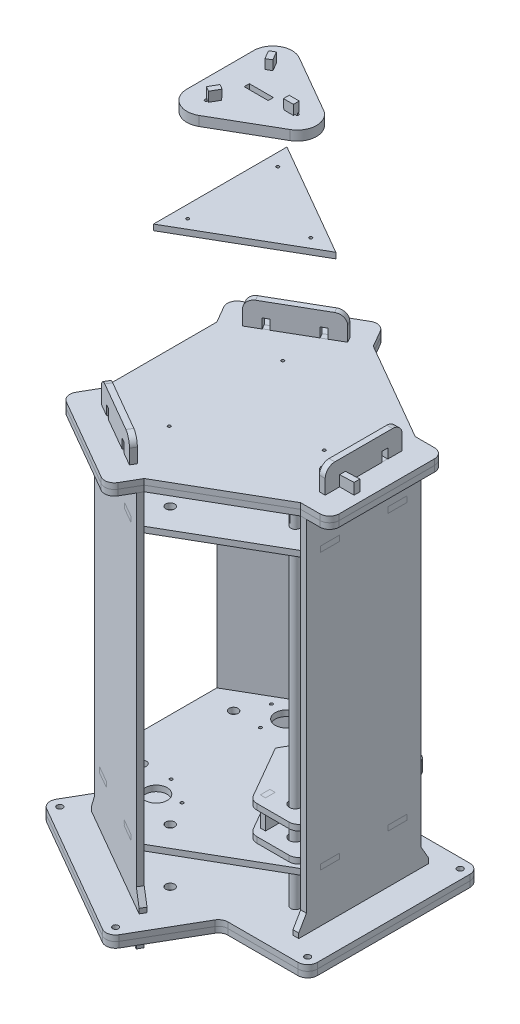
from build123d import *

# Parameters (mm, degrees)
SKETCH2_W              = 6
SKETCH2_H              = 118.934155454
BOSS_EXTRUDE1_DEPTH    = 447
BOSS_EXTRUDE2_DEPTH    = 6
BOSS_EXTRUDE3_DEPTH    = 6
BOSS_EXTRUDE4_DEPTH    = 6
BOSS_EXTRUDE5_DEPTH    = 6
SKETCH8_R              = 4.6
CUT_EXTRUDE1_DEPTH     = 469.664858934
SKETCH9_R              = 1.5
CUT_EXTRUDE3_DEPTH     = 469.664858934
SKETCH10_R             = 6
CUT_EXTRUDE5_DEPTH     = 469.664858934
BOSS_EXTRUDE6_DEPTH    = 6
BOSS_EXTRUDE7_DEPTH    = 6
SKETCH29_W             = 6
SKETCH29_H             = 118.934155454
SKETCH29_W_2           = 5.4
SKETCH29_H_2           = 118.334155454
BOSS_EXTRUDE15_DEPTH   = 6
FILLET1_R              = 10
SKETCH13_W             = 20
SKETCH13_H             = 6
CUT_EXTRUDE7_DEPTH     = 469.664858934
SKETCH30_W             = 20
SKETCH30_H             = 6
SKETCH30_W_2           = 19.4
SKETCH30_H_2           = 5.4
BOSS_EXTRUDE16_DEPTH   = 6
SKETCH15_W             = 20
SKETCH15_H             = 6
BOSS_EXTRUDE8_DEPTH    = 6
SKETCH16_R             = 1.5
CUT_EXTRUDE8_DEPTH     = 391.989449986
SKETCH17_R             = 11.5
CUT_EXTRUDE9_DEPTH     = 10
BOSS_EXTRUDE9_DEPTH    = 6
SKETCH31_W             = 6
SKETCH31_H             = 80
SKETCH31_W_2           = 5.4
SKETCH31_H_2           = 79.4
BOSS_EXTRUDE17_DEPTH   = 6
SKETCH19_W             = 19.467077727
SKETCH19_H             = 37
CUT_EXTRUDE10_DEPTH    = 6
FILLET2_R              = 10
SKETCH20_W             = 20
SKETCH20_H             = 6
CUT_EXTRUDE11_DEPTH    = 469.664858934
SKETCH32_W             = 20
SKETCH32_H             = 6
SKETCH32_W_2           = 19.4
SKETCH32_H_2           = 5.4
BOSS_EXTRUDE18_DEPTH   = 6
BOSS_EXTRUDE10_REACH   = 470.665
SKETCH21_W             = 20
SKETCH21_H             = 6
FILLET3_R              = 10
SKETCH22_W             = 6
SKETCH22_H             = 10
CUT_EXTRUDE12_DEPTH    = 6
SKETCH25_R             = 1.5
SKETCH25_W             = 5.4
SKETCH25_H             = 79.4
BOSS_EXTRUDE13_DEPTH   = 6
BOSS_EXTRUDE11_DEPTH   = 6
FILLET4_R              = 6
SKETCH24_W             = 5.4
SKETCH24_H             = 118.334155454
BOSS_EXTRUDE12_DEPTH   = 6
SKETCH27_R             = 4.6
BOSS_EXTRUDE14_DEPTH   = 385
BOSS_EXTRUDE14_2_DEPTH = 385
SKETCH28_R             = 3
CUT_EXTRUDE13_DEPTH    = 443.33104119
SKETCH33_R             = 1.5
BOSS_EXTRUDE19_DEPTH   = 10
SKETCH34_W             = 10
SKETCH34_H             = 6
CUT_EXTRUDE14_DEPTH    = 730.147961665
BOSS_EXTRUDE20_DEPTH   = 6
FILLET8_R              = 8
SKETCH37_R             = 1.5
BOSS_EXTRUDE21_DEPTH   = 6
SKETCH41_R             = 6.25
BOSS_EXTRUDE22_DEPTH   = 6
SKETCH42_R             = 2.1
BOSS_EXTRUDE23_DEPTH   = 6
SKETCH43_R             = 6.25
SKETCH43_R_2           = 6.2
SKETCH43_R_3           = 1.5
BOSS_EXTRUDE24_DEPTH   = 6
SKETCH44_R             = 1.5
BOSS_EXTRUDE25_DEPTH   = 36
SKETCH45_R             = 2.1
CUT_EXTRUDE16_DEPTH    = 615.063669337
SKETCH46_W             = 44
SKETCH46_H             = 5.4
BOSS_EXTRUDE26_DEPTH   = 23.8
SKETCH48_W             = 20
SKETCH48_H             = 5.4
CUT_EXTRUDE17_DEPTH    = 615.063669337
SKETCH49_W             = 20
SKETCH49_H             = 35.8
BOSS_EXTRUDE27_DEPTH   = 5.4
SKETCH50_W             = 83.679491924
SKETCH50_H             = 59.467077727
CUT_EXTRUDE18_DEPTH    = 615.063669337
FILLET9_R              = 10
FILLET10_R             = 10
BOSS_EXTRUDE29_DEPTH   = 5.4
SKETCH54_W             = 5.4
SKETCH54_H             = 10
CUT_EXTRUDE20_DEPTH    = 615.063669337
SKETCH55_W             = 10
SKETCH55_H             = 6
CUT_EXTRUDE21_DEPTH    = 615.063669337
BOSS_EXTRUDE31_DEPTH   = 6
CIRPATTERN1_COUNT      = 3
FILLET5_R              = 10
FILLET7_R              = 10
SKETCH36_W             = 25
SKETCH36_H             = 5.4
CUT_EXTRUDE15_DEPTH    = 743.308250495
FILLET11_R             = 8


with BuildPart() as part:
    # Sketch2 → Boss-Extrude1 (new body)
    with BuildSketch(Plane(origin=(0, 0, 0), x_dir=(1, 0, 0), z_dir=(0, 1, 0))):
        with Locations((106, 0)):
            Rectangle(SKETCH2_W, SKETCH2_H)
    extrude(amount=BOSS_EXTRUDE1_DEPTH)

    # Sketch12 → Boss-Extrude7 (add)
    with BuildSketch(Plane(origin=(109, 0, 0), x_dir=(0, 0, -1), z_dir=(1, 0, 0))):
        Polygon((-59.467077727, 37), (-59.467077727, 55.856406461), (-67.467077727, 42), (-67.467077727, 37), align=None)
    boss_extrude7 = extrude(amount=-BOSS_EXTRUDE7_DEPTH)

    # Mirror1: Boss-Extrude7 across plane
    add(boss_extrude7.mirror(Plane.XY))

    # Sketch13 → Cut-Extrude7 (cut, through all)
    with BuildSketch(Plane(origin=(109, 0, 0), x_dir=(0, 0, -1), z_dir=(1, 0, 0))):
        with Locations((-35, 90)):
            Rectangle(SKETCH13_W, SKETCH13_H)
    cut_extrude7 = extrude(amount=-CUT_EXTRUDE7_DEPTH, mode=Mode.SUBTRACT)

    # Sketch30 → Boss-Extrude16 (add)
    with BuildSketch(Plane(origin=(109, 0, 0), x_dir=(0, 0, -1), z_dir=(1, 0, 0))):
        with Locations((-35, 90)):
            Rectangle(SKETCH30_W, SKETCH30_H)
        with Locations((-35, 90)):
            Rectangle(SKETCH30_W_2, SKETCH30_H_2, mode=Mode.SUBTRACT)
    boss_extrude16 = extrude(amount=-BOSS_EXTRUDE16_DEPTH)

    # Mirror3: Cut-Extrude7 across plane
    add(cut_extrude7.mirror(Plane.XY), mode=Mode.SUBTRACT)

    # Mirror3 2: Boss-Extrude16 across plane
    add(boss_extrude16.mirror(Plane.XY))

    # Sketch19 → Cut-Extrude10 (cut)
    with BuildSketch(Plane(origin=(109, 0, 0), x_dir=(0, 0, -1), z_dir=(1, 0, 0))):
        with Locations((-49.733538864, 428.5)):
            Rectangle(SKETCH19_W, SKETCH19_H)
        with Locations((49.733538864, 428.5)):
            Rectangle(SKETCH19_W, SKETCH19_H)
    extrude(amount=-CUT_EXTRUDE10_DEPTH, mode=Mode.SUBTRACT)

    # Sketch20 → Cut-Extrude11 (cut, through all)
    with BuildSketch(Plane(origin=(109, 0, 0), x_dir=(0, 0, -1), z_dir=(1, 0, 0))):
        with Locations((-35, 376)):
            Rectangle(SKETCH20_W, SKETCH20_H)
    cut_extrude11 = extrude(amount=-CUT_EXTRUDE11_DEPTH, mode=Mode.SUBTRACT)

    # Sketch32 → Boss-Extrude18 (add)
    with BuildSketch(Plane(origin=(109, 0, 0), x_dir=(0, 0, -1), z_dir=(1, 0, 0))):
        with Locations((-35, 376)):
            Rectangle(SKETCH32_W, SKETCH32_H)
        with Locations((-35, 376)):
            Rectangle(SKETCH32_W_2, SKETCH32_H_2, mode=Mode.SUBTRACT)
    boss_extrude18 = extrude(amount=-BOSS_EXTRUDE18_DEPTH)

    # Mirror5: Cut-Extrude11 across plane
    add(cut_extrude11.mirror(Plane.XY), mode=Mode.SUBTRACT)

    # Mirror5 2: Boss-Extrude18 across plane
    add(boss_extrude18.mirror(Plane.XY))

    # Fillet3
    fillet3_edges = [part.edges().sort_by_distance(p)[0] for p in [
        (106, 447, 40),
        (106, 447, -40),
    ]]
    fillet(fillet3_edges, radius=FILLET3_R)

    # Sketch22 → Cut-Extrude12 (cut)
    with BuildSketch(Plane.XY.offset(25)):
        with Locations((106, 427)):
            Rectangle(SKETCH22_W, SKETCH22_H)
        with Locations((106, 20)):
            Rectangle(SKETCH22_W, SKETCH22_H)
    cut_extrude12 = extrude(amount=-CUT_EXTRUDE12_DEPTH, mode=Mode.SUBTRACT)

    # Mirror7: Cut-Extrude12 across plane
    add(cut_extrude12.mirror(Plane.XY), mode=Mode.SUBTRACT)


with BuildPart() as body_2:
    # Sketch4 → Boss-Extrude2 (new body)
    with BuildSketch(Plane(origin=(0, 31, 0), x_dir=(1, 0, 0), z_dir=(0, 1, 0))):
        Polygon((51.5, -89.20061659), (0, 0), (51.5, 89.20061659), (103, 59.467077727), (103, -59.467077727), align=None)
    extrude(amount=BOSS_EXTRUDE2_DEPTH)


with BuildPart() as body_3:
    # Sketch5 → Boss-Extrude3 (new body)
    with BuildSketch(Plane(origin=(0, 87, 0), x_dir=(1, 0, 0), z_dir=(0, 1, 0))):
        Polygon((51.5, 89.20061659), (0, 0), (51.5, -89.20061659), (103, -59.467077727), (103, 59.467077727), align=None)
    extrude(amount=BOSS_EXTRUDE3_DEPTH)


with BuildPart() as body_4:
    # Sketch6 → Boss-Extrude4 (new body)
    with BuildSketch(Plane(origin=(0, 373, 0), x_dir=(1, 0, 0), z_dir=(0, 1, 0))):
        Polygon((51.5, 89.20061659), (0, 0), (51.5, -89.20061659), (103, -59.467077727), (103, 59.467077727), align=None)
    extrude(amount=BOSS_EXTRUDE4_DEPTH)


with BuildPart() as body_5:
    # Sketch7 → Boss-Extrude5 (new body)
    with BuildSketch(Plane(origin=(0, 410, 0), x_dir=(1, 0, 0), z_dir=(0, 1, 0))):
        Polygon((51.5, 89.20061659), (0, 0), (51.5, -89.20061659), (103, -59.467077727), (103, 59.467077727), align=None)
    extrude(amount=BOSS_EXTRUDE5_DEPTH)


with BuildPart() as cut_extrude1_tool:
    # Sketch8 → Cut-Extrude1 (new, through all)
    with BuildSketch(Plane(origin=(0, 0, 0), x_dir=(1, 0, 0), z_dir=(0, 1, 0))):
        with Locations(Location((78, 40, 0), (0, 0, 270))):
            Circle(SKETCH8_R)
        with Locations(Location((78, -40, 0), (0, 0, 270))):
            Circle(SKETCH8_R)
    extrude(amount=CUT_EXTRUDE1_DEPTH)


with BuildPart() as body_2_1:
    add(body_2.part)

    # Cut-Extrude1: cut by cut_extrude1_tool
    add(cut_extrude1_tool.part, mode=Mode.SUBTRACT)

    # Sketch11 → Boss-Extrude6 (add)
    with BuildSketch(Plane(origin=(0, 37, 0), x_dir=(1, 0, 0), z_dir=(0, 1, 0))):
        Polygon((51.5, 89.20061659), (140, 89.20061659), (140, -89.20061659), (51.5, -89.20061659), (103, -59.467077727), (109, -59.467077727), (109, 59.467077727), (103, 59.467077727), align=None)
    extrude(amount=-BOSS_EXTRUDE6_DEPTH)

    # Sketch29 → Boss-Extrude15 (add)
    with BuildSketch(Plane(origin=(0, 37, 0), x_dir=(1, 0, 0), z_dir=(0, 1, 0))):
        with Locations((106, 0)):
            Rectangle(SKETCH29_W, SKETCH29_H)
        with Locations((106, 0)):
            Rectangle(SKETCH29_W_2, SKETCH29_H_2, mode=Mode.SUBTRACT)
    extrude(amount=-BOSS_EXTRUDE15_DEPTH)

    # Fillet1
    fillet1_edges = [body_2_1.edges().sort_by_distance(p)[0] for p in [
        (140, 34, -89.20061659),
        (140, 34, 89.20061659),
    ]]
    fillet(fillet1_edges, radius=FILLET1_R)


with BuildPart() as body_3_1:
    add(body_3.part)

    # Cut-Extrude1: cut by cut_extrude1_tool
    add(cut_extrude1_tool.part, mode=Mode.SUBTRACT)


with BuildPart() as body_4_1:
    add(body_4.part)

    # Cut-Extrude1: cut by cut_extrude1_tool
    add(cut_extrude1_tool.part, mode=Mode.SUBTRACT)


with BuildPart() as body_5_1:
    add(body_5.part)

    # Cut-Extrude1: cut by cut_extrude1_tool
    add(cut_extrude1_tool.part, mode=Mode.SUBTRACT)


with BuildPart() as cut_extrude3_tool:
    # Sketch9 → Cut-Extrude3 (new, through all)
    with BuildSketch(Plane(origin=(0, 0, 0), x_dir=(1, 0, 0), z_dir=(0, 1, 0))):
        with Locations(Location((68, 0, 0), (0, 0, 270))):
            Circle(SKETCH9_R)
    extrude(amount=CUT_EXTRUDE3_DEPTH)


with BuildPart() as body_4_2:
    add(body_4_1.part)

    # Cut-Extrude3: cut by cut_extrude3_tool
    add(cut_extrude3_tool.part, mode=Mode.SUBTRACT)


with BuildPart() as body_5_2:
    add(body_5_1.part)

    # Cut-Extrude3: cut by cut_extrude3_tool
    add(cut_extrude3_tool.part, mode=Mode.SUBTRACT)


with BuildPart() as cut_extrude5_tool:
    # Sketch10 → Cut-Extrude5 (new, through all)
    with BuildSketch(Plane(origin=(0, 0, 0), x_dir=(1, 0, 0), z_dir=(0, 1, 0))):
        with Locations(Location((78, 0, 0), (0, 0, 270))):
            Circle(SKETCH10_R)
    extrude(amount=CUT_EXTRUDE5_DEPTH)


with BuildPart() as body_3_2:
    add(body_3_1.part)

    # Cut-Extrude5: cut by cut_extrude5_tool
    add(cut_extrude5_tool.part, mode=Mode.SUBTRACT)

    # Sketch15 → Boss-Extrude8 (add)
    with BuildSketch(Plane(origin=(103, 0, 0), x_dir=(0, 0, -1), z_dir=(1, 0, 0))):
        with Locations((-35, 90)):
            Rectangle(SKETCH15_W, SKETCH15_H)
    boss_extrude8 = extrude(amount=BOSS_EXTRUDE8_DEPTH)

    # Mirror4: Boss-Extrude8 across plane
    add(boss_extrude8.mirror(Plane.XY))

    # Sketch16 → Cut-Extrude8 (cut, through all)
    with BuildSketch(Plane(origin=(0, 93, 0), x_dir=(1, 0, 0), z_dir=(0, 1, 0))):
        with Locations(Location((62.5, -15.5, 0), (0, 0, 270))):
            Circle(SKETCH16_R)
        with Locations(Location((62.5, 15.5, 0), (0, 0, 270))):
            Circle(SKETCH16_R)
        with Locations(Location((93.5, 15.5, 0), (0, 0, 270))):
            Circle(SKETCH16_R)
        with Locations(Location((93.5, -15.5, 0), (0, 0, 270))):
            Circle(SKETCH16_R)
    extrude(amount=-CUT_EXTRUDE8_DEPTH, mode=Mode.SUBTRACT)

    # Sketch17 → Cut-Extrude9 (cut)
    with BuildSketch(Plane(origin=(0, 93, 0), x_dir=(1, 0, 0), z_dir=(0, 1, 0))):
        with Locations(Location((78, 0, 0), (0, 0, 270))):
            Circle(SKETCH17_R)
    extrude(amount=-CUT_EXTRUDE9_DEPTH, mode=Mode.SUBTRACT)


with BuildPart() as body_4_3:
    add(body_4_2.part)

    # Cut-Extrude5: cut by cut_extrude5_tool
    add(cut_extrude5_tool.part, mode=Mode.SUBTRACT)

    # Sketch21 → Boss-Extrude10 (add, up to next)
    with BuildSketch(Plane(origin=(109, 0, 0), x_dir=(0, 0, -1), z_dir=(1, 0, 0)), mode=Mode.PRIVATE) as boss_extrude10_sk1:
        with Locations((-35, 376)):
            Rectangle(SKETCH21_W, SKETCH21_H)
    boss_extrude10_tool1 = extrude(boss_extrude10_sk1.sketch, amount=-BOSS_EXTRUDE10_REACH, mode=Mode.PRIVATE) - body_4_3.part
    boss_extrude10 = boss_extrude10_tool1.solids().sort_by_distance((109, 376, 35))[0]
    add(boss_extrude10)

    # Mirror6: Boss-Extrude10 across plane
    add(boss_extrude10.mirror(Plane.XY))


with BuildPart() as body_5_3:
    add(body_5_2.part)

    # Cut-Extrude5: cut by cut_extrude5_tool
    add(cut_extrude5_tool.part, mode=Mode.SUBTRACT)

    # Sketch18 → Boss-Extrude9 (add)
    with BuildSketch(Plane(origin=(0, 416, 0), x_dir=(1, 0, 0), z_dir=(0, 1, 0))):
        Polygon((103, 59.467077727), (133, 59.467077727), (133, -59.467077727), (103, -59.467077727), (103, -40), (109, -40), (109, 40), (103, 40), align=None)
    extrude(amount=-BOSS_EXTRUDE9_DEPTH)

    # Sketch31 → Boss-Extrude17 (add)
    with BuildSketch(Plane(origin=(0, 416, 0), x_dir=(1, 0, 0), z_dir=(0, 1, 0))):
        with Locations((106, 0)):
            Rectangle(SKETCH31_W, SKETCH31_H)
        with Locations((106, 0)):
            Rectangle(SKETCH31_W_2, SKETCH31_H_2, mode=Mode.SUBTRACT)
    extrude(amount=-BOSS_EXTRUDE17_DEPTH)

    # Fillet2
    fillet2_edges = [body_5_3.edges().sort_by_distance(p)[0] for p in [
        (133, 413, -59.467077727),
        (133, 413, 59.467077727),
    ]]
    fillet(fillet2_edges, radius=FILLET2_R)


with BuildPart() as body_6:
    # Sketch25 → Boss-Extrude13 (new body)
    with BuildSketch(Plane(origin=(0, 416, 0), x_dir=(1, 0, 0), z_dir=(0, 1, 0))):
        with BuildLine():
            Line((133, -49.467077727), (133, 49.467077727))
            ThreePointArc((133, 49.467077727), (130.071067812, 56.538145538), (123, 59.467077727))
            Line((123, 59.467077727), (103, 59.467077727))
            Line((103, 59.467077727), (51.5, 89.20061659))
            Line((51.5, 89.20061659), (0, 0))
            Line((0, 0), (51.5, -89.20061659))
            Line((51.5, -89.20061659), (103, -59.467077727))
            Line((103, -59.467077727), (123, -59.467077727))
            ThreePointArc((123, -59.467077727), (130.071067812, -56.538145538), (133, -49.467077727))
        make_face()
        with Locations(Location((68, 0, 0), (0, 0, 270))):
            Circle(SKETCH25_R, mode=Mode.SUBTRACT)
        with Locations((106, 0)):
            Rectangle(SKETCH25_W, SKETCH25_H, mode=Mode.SUBTRACT)
    extrude(amount=BOSS_EXTRUDE13_DEPTH)


with BuildPart() as body_7:
    # Sketch23 → Boss-Extrude11 (new body)
    with BuildSketch(Plane.XY.offset(19)):
        Polygon((88, 422), (124, 422), (124, 433.523811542), (88, 432.266663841), align=None)
    extrude(amount=BOSS_EXTRUDE11_DEPTH)

    # Fillet4
    fillet4_edges = [body_7.edges().sort_by_distance(p)[0] for p in [
        (88, 432.266663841, 22),
    ]]
    fillet(fillet4_edges, radius=FILLET4_R)


with BuildPart() as body_8:
    # Sketch24 → Boss-Extrude12 (new body)
    with BuildSketch(Plane.XZ.offset(-31)):
        with BuildLine():
            Line((0, 0), (51.5, 89.20061659))
            Line((51.5, 89.20061659), (130, 89.20061659))
            ThreePointArc((130, 89.20061659), (137.071067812, 86.271684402), (140, 79.20061659))
            Line((140, 79.20061659), (140, -79.20061659))
            ThreePointArc((140, -79.20061659), (137.071067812, -86.271684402), (130, -89.20061659))
            Line((130, -89.20061659), (51.5, -89.20061659))
            Line((51.5, -89.20061659), (0, 0))
        make_face()
        with Locations((106, 0)):
            Rectangle(SKETCH24_W, SKETCH24_H, mode=Mode.SUBTRACT)
    extrude(amount=BOSS_EXTRUDE12_DEPTH)


with BuildPart() as body_9:
    # Sketch27 → Boss-Extrude14 (new body)
    with BuildSketch(Plane(origin=(0, 31, 0), x_dir=(1, 0, 0), z_dir=(0, 1, 0))):
        with Locations(Location((78, -40, 0), (0, 0, 90))):
            Circle(SKETCH27_R)
    extrude(amount=BOSS_EXTRUDE14_DEPTH)


with BuildPart() as body_10:
    # Sketch27 → Boss-Extrude14 2 (new body)
    with BuildSketch(Plane(origin=(0, 31, 0), x_dir=(1, 0, 0), z_dir=(0, 1, 0))):
        with Locations(Location((78, 40, 0), (0, 0, 90))):
            Circle(SKETCH27_R)
    extrude(amount=BOSS_EXTRUDE14_2_DEPTH)


with BuildPart() as cut_extrude13_tool:
    # Sketch28 → Cut-Extrude13 (new, through all)
    with BuildSketch(Plane(origin=(0, 37, 0), x_dir=(1, 0, 0), z_dir=(0, 1, 0))):
        with Locations(Location((130, 79.20061659, 0), (0, 0, 90))):
            Circle(SKETCH28_R)
        with Locations(Location((130, -79.20061659, 0), (0, 0, 90))):
            Circle(SKETCH28_R)
    extrude(amount=-CUT_EXTRUDE13_DEPTH)


with BuildPart() as body_2_2:
    add(body_2_1.part)

    # Cut-Extrude13: cut by cut_extrude13_tool
    add(cut_extrude13_tool.part, mode=Mode.SUBTRACT)


with BuildPart() as body_8_1:
    add(body_8.part)

    # Cut-Extrude13: cut by cut_extrude13_tool
    add(cut_extrude13_tool.part, mode=Mode.SUBTRACT)


with BuildPart() as body_11:
    # Sketch33 → Boss-Extrude19 (new body)
    with BuildSketch(Plane(origin=(0, 700, 0), x_dir=(1, 0, 0), z_dir=(0, 1, 0))):
        with BuildLine():
            Line((0, 0), (20, 34.641016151))
            Line((20, 34.641016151), (50, 17.320508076))
            ThreePointArc((50, 17.320508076), (60, 0), (50, -17.320508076))
            Line((50, -17.320508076), (20, -34.641016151))
            Line((20, -34.641016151), (0, 0))
        make_face()
        with Locations(Location((40, 0, 0), (0, 0, 270))):
            Circle(SKETCH33_R, mode=Mode.SUBTRACT)
    extrude(amount=BOSS_EXTRUDE19_DEPTH)

    # Sketch34 → Cut-Extrude14 (cut, through all)
    with BuildSketch(Plane(origin=(0, 710, 0), x_dir=(1, 0, 0), z_dir=(0, 1, 0))):
        with Locations((34, 0)):
            Rectangle(SKETCH34_W, SKETCH34_H)
    extrude(amount=-CUT_EXTRUDE14_DEPTH, mode=Mode.SUBTRACT)


with BuildPart() as body_12:
    # Sketch35 → Boss-Extrude20 (new body)
    with BuildSketch(Plane.XY.offset(-3)):
        Polygon((39, 690), (39, 720), (28.650792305, 720), (29.69841539, 690), align=None)
    extrude(amount=BOSS_EXTRUDE20_DEPTH)

    # Fillet8
    fillet8_edges = [body_12.edges().sort_by_distance(p)[0] for p in [
        (29.69841539, 690, 0),
    ]]
    fillet(fillet8_edges, radius=FILLET8_R)


with BuildPart() as body_13:
    # Sketch37 → Boss-Extrude21 (new body)
    with BuildSketch(Plane(origin=(0, 600, 0), x_dir=(1, 0, 0), z_dir=(0, 1, 0))):
        Polygon((0, 0), (20, 34.641016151), (80, 0), (20, -34.641016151), align=None)
        with Locations(Location((54, 0, 0), (0, 0, 270))):
            Circle(SKETCH37_R, mode=Mode.SUBTRACT)
    extrude(amount=BOSS_EXTRUDE21_DEPTH)


with BuildPart() as body_14:
    # Sketch41 → Boss-Extrude22 (new body)
    with BuildSketch(Plane(origin=(0, 93, 0), x_dir=(1, 0, 0), z_dir=(0, 1, 0))):
        Polygon((101, 59.467077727), (51.653841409, 59.467077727), (17.320508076, 0), (51.653841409, -59.467077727), (101, -59.467077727), align=None)
        with Locations(Location((78, 40, 0), (0, 0, 270))):
            Circle(SKETCH41_R, mode=Mode.SUBTRACT)
        with Locations(Location((78, -40, 0), (0, 0, 270))):
            Circle(SKETCH41_R, mode=Mode.SUBTRACT)
    extrude(amount=BOSS_EXTRUDE22_DEPTH)


with BuildPart() as body_15:
    # Sketch42 → Boss-Extrude23 (new body)
    with BuildSketch(Plane(origin=(0, 99, 0), x_dir=(1, 0, 0), z_dir=(0, 1, 0))):
        with BuildLine():
            Line((92.090445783, 3.594632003), (74.06781974, 14))
            ThreePointArc((74.06781974, 14), (70.729132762, 12.593511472), (67.841734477, 10.405367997))
            Line((67.841734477, 10.405367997), (67.841734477, -10.405367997))
            ThreePointArc((67.841734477, -10.405367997), (70.729132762, -12.593511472), (74.06781974, -14))
            Line((74.06781974, -14), (92.090445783, -3.594632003))
            ThreePointArc((92.090445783, -3.594632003), (92.541734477, 0), (92.090445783, 3.594632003))
        make_face()
        with Locations(Location((89.547005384, 0, 0), (0, 0, 270))):
            Circle(SKETCH42_R, mode=Mode.SUBTRACT)
        with Locations(Location((72.226497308, -10, 0), (0, 0, 270))):
            Circle(SKETCH42_R, mode=Mode.SUBTRACT)
        with Locations(Location((72.226497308, 10, 0), (0, 0, 270))):
            Circle(SKETCH42_R, mode=Mode.SUBTRACT)
    extrude(amount=BOSS_EXTRUDE23_DEPTH)


with BuildPart() as body_16:
    # Sketch43 → Boss-Extrude24 (new body)
    with BuildSketch(Plane(origin=(0, 122.8, 0), x_dir=(1, 0, 0), z_dir=(0, 1, 0))):
        Polygon((101, -59.467077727), (101, 59.467077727), (51.653841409, 59.467077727), (17.320508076, 0), (51.653841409, -59.467077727), align=None)
        with Locations(Location((78, -40, 0), (0, 0, 270))):
            Circle(SKETCH43_R, mode=Mode.SUBTRACT)
        with Locations(Location((78, 40, 0), (0, 0, 270))):
            Circle(SKETCH43_R, mode=Mode.SUBTRACT)
        with Locations(Location((78, 0, 0), (0, 0, 270))):
            Circle(SKETCH43_R_2, mode=Mode.SUBTRACT)
        with Locations(Location((68, 0, 0), (0, 0, 270))):
            Circle(SKETCH43_R_3, mode=Mode.SUBTRACT)
    extrude(amount=BOSS_EXTRUDE24_DEPTH)


with BuildPart() as body_17:
    # Sketch44 → Boss-Extrude25 (new body)
    with BuildSketch(Plane(origin=(0, 99, 0), x_dir=(1, 0, 0), z_dir=(0, 1, 0))):
        with Locations(Location((68, 0, 0), (0, 0, 270))):
            Circle(SKETCH44_R)
    extrude(amount=BOSS_EXTRUDE25_DEPTH)


with BuildPart() as cut_extrude16_tool:
    # Sketch45 → Cut-Extrude16 (new, through all)
    with BuildSketch(Plane(origin=(0, 128.8, 0), x_dir=(1, 0, 0), z_dir=(0, 1, 0))):
        with Locations(Location((72.226497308, 10, 0), (0, 0, 270))):
            Circle(SKETCH45_R)
        with Locations(Location((89.547005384, 0, 0), (0, 0, 270))):
            Circle(SKETCH45_R)
        with Locations(Location((72.226497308, -10, 0), (0, 0, 270))):
            Circle(SKETCH45_R)
    extrude(amount=-CUT_EXTRUDE16_DEPTH)


with BuildPart() as body_14_1:
    add(body_14.part)

    # Cut-Extrude16: cut by cut_extrude16_tool
    add(cut_extrude16_tool.part, mode=Mode.SUBTRACT)


with BuildPart() as body_16_1:
    add(body_16.part)

    # Cut-Extrude16: cut by cut_extrude16_tool
    add(cut_extrude16_tool.part, mode=Mode.SUBTRACT)


with BuildPart() as body_18:
    # Sketch46 → Boss-Extrude26 (new body)
    with BuildSketch(Plane(origin=(0, 99, 0), x_dir=(1, 0, 0), z_dir=(0, 1, 0))):
        with Locations((79, -20)):
            Rectangle(SKETCH46_W, SKETCH46_H)
    extrude(amount=BOSS_EXTRUDE26_DEPTH)

    # Sketch49 → Boss-Extrude27 (add)
    with BuildSketch(Plane.XY.offset(22.7)):
        with Locations((78, 110.9)):
            Rectangle(SKETCH49_W, SKETCH49_H)
    extrude(amount=-BOSS_EXTRUDE27_DEPTH)


with BuildPart() as cut_extrude17_tool:
    # Sketch48 → Cut-Extrude17 (new, through all)
    with BuildSketch(Plane(origin=(0, 128.8, 0), x_dir=(1, 0, 0), z_dir=(0, 1, 0))):
        with Locations((78, -20)):
            Rectangle(SKETCH48_W, SKETCH48_H)
    extrude(amount=-CUT_EXTRUDE17_DEPTH)


with BuildPart() as body_16_2:
    add(body_16_1.part)

    # Cut-Extrude17: cut by cut_extrude17_tool
    add(cut_extrude17_tool.part, mode=Mode.SUBTRACT)


with BuildPart() as body_14_2:
    add(body_14_1.part)

    # Cut-Extrude17: cut by cut_extrude17_tool
    add(cut_extrude17_tool.part, mode=Mode.SUBTRACT)


with BuildPart() as cut_extrude18_tool:
    # Sketch50 → Cut-Extrude18 (new, through all)
    with BuildSketch(Plane(origin=(0, 128.8, 0), x_dir=(1, 0, 0), z_dir=(0, 1, 0))):
        with Locations((59.160254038, 29.733538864)):
            Rectangle(SKETCH50_W, SKETCH50_H)
    extrude(amount=-CUT_EXTRUDE18_DEPTH)


with BuildPart() as body_14_3:
    add(body_14_2.part)

    # Cut-Extrude18: cut by cut_extrude18_tool
    add(cut_extrude18_tool.part, mode=Mode.SUBTRACT)

    # Fillet10
    fillet10_edges = [body_14_3.edges().sort_by_distance(p)[0] for p in [
        (101, 96, 59.467077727),
        (51.653841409, 96, 59.467077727),
    ]]
    fillet(fillet10_edges, radius=FILLET10_R)


with BuildPart() as body_16_3:
    add(body_16_2.part)

    # Cut-Extrude18: cut by cut_extrude18_tool
    add(cut_extrude18_tool.part, mode=Mode.SUBTRACT)

    # Fillet9
    fillet9_edges = [body_16_3.edges().sort_by_distance(p)[0] for p in [
        (51.653841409, 125.8, 59.467077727),
        (101, 125.8, 59.467077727),
    ]]
    fillet(fillet9_edges, radius=FILLET9_R)


with BuildPart() as body_19:
    # Sketch53 → Boss-Extrude29 (new body)
    with BuildSketch(Plane.ZY.offset(-57)):
        Polygon((0, 128.8), (10, 128.8), (10, 122.8), (40, 122.8), (40, 128.8), (50, 128.8), (50, 93), (40, 93), (40, 99), (10, 99), (10, 93), (0, 93), align=None)
    extrude(amount=BOSS_EXTRUDE29_DEPTH)

    # Mirror9: body 19 across plane


with BuildPart() as cut_extrude20_tool:
    # Sketch54 → Cut-Extrude20 (new, through all)
    with BuildSketch(Plane(origin=(0, 128.8, 0), x_dir=(1, 0, 0), z_dir=(0, 1, 0))):
        with Locations((54.3, -5)):
            Rectangle(SKETCH54_W, SKETCH54_H)
        with Locations((54.3, -45)):
            Rectangle(SKETCH54_W, SKETCH54_H)
    extrude(amount=-CUT_EXTRUDE20_DEPTH)


with BuildPart() as body_16_4:
    add(body_16_3.part)

    # Cut-Extrude20: cut by cut_extrude20_tool
    add(cut_extrude20_tool.part, mode=Mode.SUBTRACT)


with BuildPart() as body_14_4:
    add(body_14_3.part)

    # Cut-Extrude20: cut by cut_extrude20_tool
    add(cut_extrude20_tool.part, mode=Mode.SUBTRACT)


with BuildPart() as cut_extrude21_tool:
    # Sketch55 → Cut-Extrude21 (new, through all)
    with BuildSketch(Plane(origin=(0, 128.8, 0), x_dir=(1, 0, 0), z_dir=(0, 1, 0))):
        with Locations((62, 0)):
            Rectangle(SKETCH55_W, SKETCH55_H)
    extrude(amount=-CUT_EXTRUDE21_DEPTH)


with BuildPart() as body_16_5:
    add(body_16_4.part)

    # Cut-Extrude21: cut by cut_extrude21_tool
    add(cut_extrude21_tool.part, mode=Mode.SUBTRACT)

    # Mirror8: body 16 across plane


with BuildPart() as body_14_5:
    add(body_14_4.part)

    # Cut-Extrude21: cut by cut_extrude21_tool
    add(cut_extrude21_tool.part, mode=Mode.SUBTRACT)

    # Mirror10: body 14 across plane


with BuildPart() as body_20:
    # Sketch56 → Boss-Extrude31 (new body)
    with BuildSketch(Plane(origin=(0, 0, 3), x_dir=(-1, 0, 0), z_dir=(0, 0, -1))):
        Polygon((-67, 138.8), (-56.825449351, 138.8), (-57.279281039, 112.8), (-67, 112.8), align=None)
    extrude(amount=BOSS_EXTRUDE31_DEPTH)

    # Fillet11
    fillet11_edges = [body_20.edges().sort_by_distance(p)[0] for p in [
        (57.279281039, 112.8, 0),
    ]]
    fillet(fillet11_edges, radius=FILLET11_R)


with BuildPart() as cirpattern1_1:
    # CirPattern1: pattern copy
    add(body_13.part.rotate(Axis((0, 0, 0), (0, 1, 0)), 1 * 360 / CIRPATTERN1_COUNT))


with BuildPart() as cirpattern1_2:
    # CirPattern1: pattern copy
    add(body_13.part.rotate(Axis((0, 0, 0), (0, 1, 0)), 2 * 360 / CIRPATTERN1_COUNT))


with BuildPart() as cirpattern1_3:
    # CirPattern1: pattern copy
    add(body_8_1.part.rotate(Axis((0, 0, 0), (0, 1, 0)), 1 * 360 / CIRPATTERN1_COUNT))


with BuildPart() as cirpattern1_4:
    # CirPattern1: pattern copy
    add(body_8_1.part.rotate(Axis((0, 0, 0), (0, 1, 0)), 2 * 360 / CIRPATTERN1_COUNT))

    # Combine6: union CirPattern1_3, body 8
    add(cirpattern1_3.part)
    add(body_8_1.part)

    # Fillet7
    fillet7_edges = [cirpattern1_4.edges().sort_by_distance(p)[0] for p in [
        (-103, 28, 0),
        (51.5, 28, -89.20061659),
        (51.5, 28, 89.20061659),
    ]]
    fillet(fillet7_edges, radius=FILLET7_R)


with BuildPart() as cirpattern1_5:
    # CirPattern1: pattern copy
    add(body_6.part.rotate(Axis((0, 0, 0), (0, 1, 0)), 1 * 360 / CIRPATTERN1_COUNT))


with BuildPart() as cirpattern1_6:
    # CirPattern1: pattern copy
    add(body_6.part.rotate(Axis((0, 0, 0), (0, 1, 0)), 2 * 360 / CIRPATTERN1_COUNT))


with BuildPart() as cirpattern1_7:
    # CirPattern1: pattern copy
    add(part.part.rotate(Axis((0, 0, 0), (0, 1, 0)), 1 * 360 / CIRPATTERN1_COUNT))


with BuildPart() as cirpattern1_8:
    # CirPattern1: pattern copy
    add(part.part.rotate(Axis((0, 0, 0), (0, 1, 0)), 2 * 360 / CIRPATTERN1_COUNT))


with BuildPart() as cirpattern1_9:
    # CirPattern1: pattern copy
    add(body_4_3.part.rotate(Axis((0, 0, 0), (0, 1, 0)), 1 * 360 / CIRPATTERN1_COUNT))


with BuildPart() as cirpattern1_10:
    # CirPattern1: pattern copy
    add(body_4_3.part.rotate(Axis((0, 0, 0), (0, 1, 0)), 2 * 360 / CIRPATTERN1_COUNT))

    # Combine2: union CirPattern1_9, body 4
    add(cirpattern1_9.part)
    add(body_4_3.part)


with BuildPart() as cirpattern1_11:
    # CirPattern1: pattern copy
    add(body_5_3.part.rotate(Axis((0, 0, 0), (0, 1, 0)), 1 * 360 / CIRPATTERN1_COUNT))


with BuildPart() as cirpattern1_12:
    # CirPattern1: pattern copy
    add(body_5_3.part.rotate(Axis((0, 0, 0), (0, 1, 0)), 2 * 360 / CIRPATTERN1_COUNT))


with BuildPart() as cirpattern1_13:
    # CirPattern1: pattern copy
    add(body_3_2.part.rotate(Axis((0, 0, 0), (0, 1, 0)), 1 * 360 / CIRPATTERN1_COUNT))


with BuildPart() as cirpattern1_14:
    # CirPattern1: pattern copy
    add(body_3_2.part.rotate(Axis((0, 0, 0), (0, 1, 0)), 2 * 360 / CIRPATTERN1_COUNT))


with BuildPart() as cirpattern1_15:
    # CirPattern1: pattern copy
    add(body_2_2.part.rotate(Axis((0, 0, 0), (0, 1, 0)), 1 * 360 / CIRPATTERN1_COUNT))


with BuildPart() as cirpattern1_16:
    # CirPattern1: pattern copy
    add(body_2_2.part.rotate(Axis((0, 0, 0), (0, 1, 0)), 2 * 360 / CIRPATTERN1_COUNT))


with BuildPart() as cirpattern1_17:
    # CirPattern1: pattern copy
    add(body_11.part.rotate(Axis((0, 0, 0), (0, 1, 0)), 1 * 360 / CIRPATTERN1_COUNT))


with BuildPart() as cirpattern1_18:
    # CirPattern1: pattern copy
    add(body_11.part.rotate(Axis((0, 0, 0), (0, 1, 0)), 2 * 360 / CIRPATTERN1_COUNT))


with BuildPart() as cirpattern1_19:
    # CirPattern1: pattern copy
    add(body_12.part.rotate(Axis((0, 0, 0), (0, 1, 0)), 1 * 360 / CIRPATTERN1_COUNT))


with BuildPart() as cirpattern1_20:
    # CirPattern1: pattern copy
    add(body_12.part.rotate(Axis((0, 0, 0), (0, 1, 0)), 2 * 360 / CIRPATTERN1_COUNT))


with BuildPart() as body_11_1:
    add(body_11.part)

    # Combine7: union CirPattern1_18, CirPattern1_17
    add(cirpattern1_18.part)
    add(cirpattern1_17.part)

    # Sketch36 → Cut-Extrude15 (cut, through all)
    with BuildSketch(Plane(origin=(0, 710, 0), x_dir=(1, 0, 0), z_dir=(0, 1, 0))):
        Rectangle(SKETCH36_W, SKETCH36_H)
    extrude(amount=-CUT_EXTRUDE15_DEPTH, mode=Mode.SUBTRACT)


with BuildPart() as body_5_4:
    add(body_5_3.part)

    # Combine1: union CirPattern1_12, CirPattern1_11
    add(cirpattern1_12.part)
    add(cirpattern1_11.part)


with BuildPart() as body_3_3:
    add(body_3_2.part)

    # Combine3: union CirPattern1_14, CirPattern1_13
    add(cirpattern1_14.part)
    add(cirpattern1_13.part)


with BuildPart() as body_2_3:
    add(body_2_2.part)

    # Combine4: union CirPattern1_16, CirPattern1_15
    add(cirpattern1_16.part)
    add(cirpattern1_15.part)

    # Fillet5
    fillet5_edges = [body_2_3.edges().sort_by_distance(p)[0] for p in [
        (51.5, 34, 89.20061659),
        (-103, 34, 0),
        (51.5, 34, -89.20061659),
    ]]
    fillet(fillet5_edges, radius=FILLET5_R)


with BuildPart() as body_6_1:
    add(body_6.part)

    # Combine5: union CirPattern1_5, CirPattern1_6
    add(cirpattern1_5.part)
    add(cirpattern1_6.part)


with BuildPart() as body_13_1:
    add(body_13.part)

    # Combine8: union CirPattern1_2, CirPattern1_1
    add(cirpattern1_2.part)
    add(cirpattern1_1.part)


with BuildPart() as body_16_6:
    add(body_16_5.part)
    add(body_16_5.part.mirror(Plane(origin=(17.320508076, -2.5e-05, 0), x_dir=(1, 0, 0), z_dir=(0, 0, 1))))


with BuildPart() as body_19_1:
    add(body_19.part)
    add(body_19.part.mirror(Plane(origin=(51.6, 128.8, 0), x_dir=(1, 0, 0), z_dir=(0, 0, 1))))


with BuildPart() as body_14_6:
    add(body_14_5.part)
    add(body_14_5.part.mirror(Plane(origin=(17.320508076, -2.5e-05, 0), x_dir=(1, 0, 0), z_dir=(0, 0, 1))))


solid = Compound([part.part, body_7.part, body_9.part, body_10.part, body_12.part, body_15.part, body_17.part, body_18.part, body_20.part, cirpattern1_4.part, cirpattern1_7.part, cirpattern1_8.part, cirpattern1_10.part, cirpattern1_19.part, cirpattern1_20.part, body_11_1.part, body_5_4.part, body_3_3.part, body_2_3.part, body_6_1.part, body_13_1.part, body_16_6.part, body_19_1.part, body_14_6.part])
